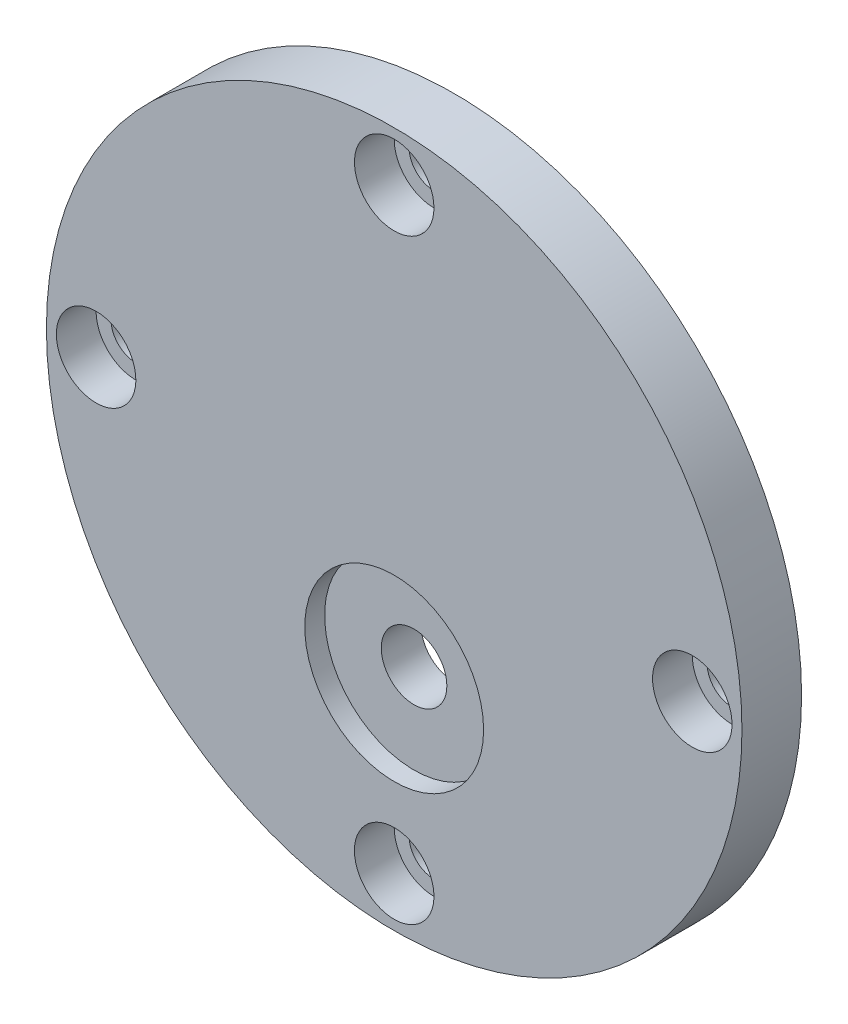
ISO-10303-21;
HEADER;
FILE_DESCRIPTION(('STEP AP214'),'2;1');
FILE_NAME('part.step','',(''),(''),'','','');
FILE_SCHEMA(('AUTOMOTIVE_DESIGN { 1 0 10303 214 1 1 1 1 }'));
ENDSEC;
DATA;
#1=APPLICATION_CONTEXT('core data for automotive mechanical design processes');
#2=APPLICATION_PROTOCOL_DEFINITION('international standard','automotive_design',2000,#1);
#3=PRODUCT_CONTEXT('',#1,'mechanical');
#4=PRODUCT('Part','Part','',(#3));
#5=PRODUCT_RELATED_PRODUCT_CATEGORY('part','',(#4));
#6=PRODUCT_DEFINITION_FORMATION('','',#4);
#7=PRODUCT_DEFINITION_CONTEXT('part definition',#1,'design');
#8=PRODUCT_DEFINITION('design','',#6,#7);
#9=PRODUCT_DEFINITION_SHAPE('','',#8);
#10=(LENGTH_UNIT() NAMED_UNIT(*) SI_UNIT(.MILLI.,.METRE.));
#11=(NAMED_UNIT(*) PLANE_ANGLE_UNIT() SI_UNIT($,.RADIAN.));
#12=(NAMED_UNIT(*) SI_UNIT($,.STERADIAN.) SOLID_ANGLE_UNIT());
#13=UNCERTAINTY_MEASURE_WITH_UNIT(LENGTH_MEASURE(1.E-05),#10,'distance_accuracy_value','');
#14=(GEOMETRIC_REPRESENTATION_CONTEXT(3) GLOBAL_UNCERTAINTY_ASSIGNED_CONTEXT((#13)) GLOBAL_UNIT_ASSIGNED_CONTEXT((#10,
#11,#12)) REPRESENTATION_CONTEXT('',''));
#15=CARTESIAN_POINT('',(0.,0.,0.));
#16=DIRECTION('',(0.,0.,1.));
#17=DIRECTION('',(1.,0.,0.));
#18=AXIS2_PLACEMENT_3D('',#15,#16,#17);
#19=CARTESIAN_POINT('',(0.,0.,6.));
#20=DIRECTION('',(0.,0.,-1.));
#21=DIRECTION('',(-1.,0.,0.));
#22=AXIS2_PLACEMENT_3D('',#19,#20,#21);
#23=CYLINDRICAL_SURFACE('',#22,35.);
#24=CARTESIAN_POINT('',(0.,0.,6.));
#25=DIRECTION('',(0.,0.,1.));
#26=DIRECTION('',(1.,0.,0.));
#27=AXIS2_PLACEMENT_3D('',#24,#25,#26);
#28=CIRCLE('',#27,35.);
#29=CARTESIAN_POINT('',(35.,0.,6.));
#30=VERTEX_POINT('',#29);
#31=EDGE_CURVE('E10',#30,#30,#28,.T.);
#32=ORIENTED_EDGE('',*,*,#31,.F.);
#33=EDGE_LOOP('',(#32));
#34=FACE_BOUND('',#33,.T.);
#35=CARTESIAN_POINT('',(0.,0.,0.));
#36=DIRECTION('',(0.,0.,1.));
#37=DIRECTION('',(1.,0.,0.));
#38=AXIS2_PLACEMENT_3D('',#35,#36,#37);
#39=CIRCLE('',#38,35.);
#40=CARTESIAN_POINT('',(35.,0.,0.));
#41=VERTEX_POINT('',#40);
#42=EDGE_CURVE('E33',#41,#41,#39,.T.);
#43=ORIENTED_EDGE('',*,*,#42,.T.);
#44=EDGE_LOOP('',(#43));
#45=FACE_BOUND('',#44,.T.);
#46=ADVANCED_FACE('F27',(#34,#45),#23,.T.);
#47=CARTESIAN_POINT('',(0.,0.,6.));
#48=DIRECTION('',(0.,0.,1.));
#49=DIRECTION('',(1.,0.,0.));
#50=AXIS2_PLACEMENT_3D('',#47,#48,#49);
#51=PLANE('',#50);
#52=CARTESIAN_POINT('',(0.,-13.,6.));
#53=DIRECTION('',(0.,0.,1.));
#54=DIRECTION('',(1.,0.,0.));
#55=AXIS2_PLACEMENT_3D('',#52,#53,#54);
#56=CIRCLE('',#55,9.);
#57=CARTESIAN_POINT('',(9.,-13.,6.));
#58=VERTEX_POINT('',#57);
#59=EDGE_CURVE('E91',#58,#58,#56,.T.);
#60=ORIENTED_EDGE('',*,*,#59,.F.);
#61=EDGE_LOOP('',(#60));
#62=FACE_BOUND('',#61,.T.);
#63=CARTESIAN_POINT('',(-30.,3.14233502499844E-13,6.));
#64=DIRECTION('',(0.,0.,1.));
#65=DIRECTION('',(0.,1.,0.));
#66=AXIS2_PLACEMENT_3D('',#63,#64,#65);
#67=CIRCLE('',#66,4.);
#68=CARTESIAN_POINT('',(-30.,4.00000000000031,6.));
#69=VERTEX_POINT('',#68);
#70=EDGE_CURVE('E67',#69,#69,#67,.T.);
#71=ORIENTED_EDGE('',*,*,#70,.F.);
#72=EDGE_LOOP('',(#71));
#73=FACE_BOUND('',#72,.T.);
#74=CARTESIAN_POINT('',(-2.09489001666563E-13,-30.,6.));
#75=DIRECTION('',(0.,0.,1.));
#76=DIRECTION('',(-1.,0.,0.));
#77=AXIS2_PLACEMENT_3D('',#74,#75,#76);
#78=CIRCLE('',#77,4.);
#79=CARTESIAN_POINT('',(-4.00000000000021,-30.,6.));
#80=VERTEX_POINT('',#79);
#81=EDGE_CURVE('E61',#80,#80,#78,.T.);
#82=ORIENTED_EDGE('',*,*,#81,.F.);
#83=EDGE_LOOP('',(#82));
#84=FACE_BOUND('',#83,.T.);
#85=CARTESIAN_POINT('',(30.,-1.04744500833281E-13,6.));
#86=DIRECTION('',(0.,0.,1.));
#87=DIRECTION('',(0.,-1.,0.));
#88=AXIS2_PLACEMENT_3D('',#85,#86,#87);
#89=CIRCLE('',#88,4.);
#90=CARTESIAN_POINT('',(30.,-4.0000000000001,6.));
#91=VERTEX_POINT('',#90);
#92=EDGE_CURVE('E55',#91,#91,#89,.T.);
#93=ORIENTED_EDGE('',*,*,#92,.F.);
#94=EDGE_LOOP('',(#93));
#95=FACE_BOUND('',#94,.T.);
#96=CARTESIAN_POINT('',(0.,30.,6.));
#97=DIRECTION('',(0.,0.,1.));
#98=DIRECTION('',(1.,0.,0.));
#99=AXIS2_PLACEMENT_3D('',#96,#97,#98);
#100=CIRCLE('',#99,4.);
#101=CARTESIAN_POINT('',(4.,30.,6.));
#102=VERTEX_POINT('',#101);
#103=EDGE_CURVE('E41',#102,#102,#100,.T.);
#104=ORIENTED_EDGE('',*,*,#103,.F.);
#105=EDGE_LOOP('',(#104));
#106=FACE_BOUND('',#105,.T.);
#107=ORIENTED_EDGE('',*,*,#31,.T.);
#108=EDGE_LOOP('',(#107));
#109=FACE_BOUND('',#108,.T.);
#110=ADVANCED_FACE('F116',(#62,#73,#84,#95,#106,#109),#51,.T.);
#111=CARTESIAN_POINT('',(0.,0.,0.));
#112=DIRECTION('',(0.,0.,1.));
#113=DIRECTION('',(1.,0.,0.));
#114=AXIS2_PLACEMENT_3D('',#111,#112,#113);
#115=PLANE('',#114);
#116=CARTESIAN_POINT('',(0.,-13.,0.));
#117=DIRECTION('',(0.,0.,1.));
#118=DIRECTION('',(1.,0.,0.));
#119=AXIS2_PLACEMENT_3D('',#116,#117,#118);
#120=CIRCLE('',#119,3.3);
#121=CARTESIAN_POINT('',(3.3,-13.,0.));
#122=VERTEX_POINT('',#121);
#123=EDGE_CURVE('E94',#122,#122,#120,.T.);
#124=ORIENTED_EDGE('',*,*,#123,.T.);
#125=EDGE_LOOP('',(#124));
#126=FACE_BOUND('',#125,.T.);
#127=CARTESIAN_POINT('',(-30.,3.14233502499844E-13,0.));
#128=DIRECTION('',(0.,0.,1.));
#129=DIRECTION('',(0.,1.,0.));
#130=AXIS2_PLACEMENT_3D('',#127,#128,#129);
#131=CIRCLE('',#130,2.5);
#132=CARTESIAN_POINT('',(-30.,2.50000000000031,0.));
#133=VERTEX_POINT('',#132);
#134=EDGE_CURVE('E82',#133,#133,#131,.T.);
#135=ORIENTED_EDGE('',*,*,#134,.T.);
#136=EDGE_LOOP('',(#135));
#137=FACE_BOUND('',#136,.T.);
#138=CARTESIAN_POINT('',(-2.09489001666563E-13,-30.,0.));
#139=DIRECTION('',(0.,0.,1.));
#140=DIRECTION('',(-1.,0.,0.));
#141=AXIS2_PLACEMENT_3D('',#138,#139,#140);
#142=CIRCLE('',#141,2.5);
#143=CARTESIAN_POINT('',(-2.50000000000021,-30.,0.));
#144=VERTEX_POINT('',#143);
#145=EDGE_CURVE('E76',#144,#144,#142,.T.);
#146=ORIENTED_EDGE('',*,*,#145,.T.);
#147=EDGE_LOOP('',(#146));
#148=FACE_BOUND('',#147,.T.);
#149=CARTESIAN_POINT('',(30.,-1.04744500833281E-13,0.));
#150=DIRECTION('',(0.,0.,1.));
#151=DIRECTION('',(0.,-1.,0.));
#152=AXIS2_PLACEMENT_3D('',#149,#150,#151);
#153=CIRCLE('',#152,2.5);
#154=CARTESIAN_POINT('',(30.,-2.5000000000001,0.));
#155=VERTEX_POINT('',#154);
#156=EDGE_CURVE('E70',#155,#155,#153,.T.);
#157=ORIENTED_EDGE('',*,*,#156,.T.);
#158=EDGE_LOOP('',(#157));
#159=FACE_BOUND('',#158,.T.);
#160=CARTESIAN_POINT('',(0.,30.,0.));
#161=DIRECTION('',(0.,0.,1.));
#162=DIRECTION('',(1.,0.,0.));
#163=AXIS2_PLACEMENT_3D('',#160,#161,#162);
#164=CIRCLE('',#163,2.5);
#165=CARTESIAN_POINT('',(2.5,30.,0.));
#166=VERTEX_POINT('',#165);
#167=EDGE_CURVE('E46',#166,#166,#164,.T.);
#168=ORIENTED_EDGE('',*,*,#167,.T.);
#169=EDGE_LOOP('',(#168));
#170=FACE_BOUND('',#169,.T.);
#171=ORIENTED_EDGE('',*,*,#42,.F.);
#172=EDGE_LOOP('',(#171));
#173=FACE_BOUND('',#172,.T.);
#174=ADVANCED_FACE('F119',(#126,#137,#148,#159,#170,#173),#115,.F.);
#175=CARTESIAN_POINT('',(0.,30.,2.));
#176=DIRECTION('',(0.,0.,1.));
#177=DIRECTION('',(1.,0.,0.));
#178=AXIS2_PLACEMENT_3D('',#175,#176,#177);
#179=CYLINDRICAL_SURFACE('',#178,4.);
#180=CARTESIAN_POINT('',(0.,30.,2.));
#181=DIRECTION('',(0.,0.,1.));
#182=DIRECTION('',(1.,0.,0.));
#183=AXIS2_PLACEMENT_3D('',#180,#181,#182);
#184=CIRCLE('',#183,4.);
#185=CARTESIAN_POINT('',(4.,30.,2.));
#186=VERTEX_POINT('',#185);
#187=EDGE_CURVE('E37',#186,#186,#184,.T.);
#188=ORIENTED_EDGE('',*,*,#187,.F.);
#189=EDGE_LOOP('',(#188));
#190=FACE_BOUND('',#189,.T.);
#191=ORIENTED_EDGE('',*,*,#103,.T.);
#192=EDGE_LOOP('',(#191));
#193=FACE_BOUND('',#192,.T.);
#194=ADVANCED_FACE('F128',(#190,#193),#179,.F.);
#195=CARTESIAN_POINT('',(0.,30.,2.));
#196=DIRECTION('',(0.,0.,1.));
#197=DIRECTION('',(1.,0.,0.));
#198=AXIS2_PLACEMENT_3D('',#195,#196,#197);
#199=PLANE('',#198);
#200=CARTESIAN_POINT('',(0.,30.,2.));
#201=DIRECTION('',(0.,0.,1.));
#202=DIRECTION('',(1.,0.,0.));
#203=AXIS2_PLACEMENT_3D('',#200,#201,#202);
#204=CIRCLE('',#203,2.5);
#205=CARTESIAN_POINT('',(2.5,30.,2.));
#206=VERTEX_POINT('',#205);
#207=EDGE_CURVE('E49',#206,#206,#204,.T.);
#208=ORIENTED_EDGE('',*,*,#207,.F.);
#209=EDGE_LOOP('',(#208));
#210=FACE_BOUND('',#209,.T.);
#211=ORIENTED_EDGE('',*,*,#187,.T.);
#212=EDGE_LOOP('',(#211));
#213=FACE_BOUND('',#212,.T.);
#214=ADVANCED_FACE('F130',(#210,#213),#199,.T.);
#215=CARTESIAN_POINT('',(0.,30.,0.));
#216=DIRECTION('',(0.,0.,1.));
#217=DIRECTION('',(1.,0.,0.));
#218=AXIS2_PLACEMENT_3D('',#215,#216,#217);
#219=CYLINDRICAL_SURFACE('',#218,2.5);
#220=ORIENTED_EDGE('',*,*,#167,.F.);
#221=EDGE_LOOP('',(#220));
#222=FACE_BOUND('',#221,.T.);
#223=ORIENTED_EDGE('',*,*,#207,.T.);
#224=EDGE_LOOP('',(#223));
#225=FACE_BOUND('',#224,.T.);
#226=ADVANCED_FACE('F137',(#222,#225),#219,.F.);
#227=CARTESIAN_POINT('',(30.,-1.04744500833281E-13,2.));
#228=DIRECTION('',(0.,0.,1.));
#229=DIRECTION('',(1.,0.,0.));
#230=AXIS2_PLACEMENT_3D('',#227,#228,#229);
#231=CYLINDRICAL_SURFACE('',#230,4.);
#232=CARTESIAN_POINT('',(30.,-1.04744500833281E-13,2.));
#233=DIRECTION('',(0.,0.,1.));
#234=DIRECTION('',(0.,-1.,0.));
#235=AXIS2_PLACEMENT_3D('',#232,#233,#234);
#236=CIRCLE('',#235,4.);
#237=CARTESIAN_POINT('',(30.,-4.0000000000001,2.));
#238=VERTEX_POINT('',#237);
#239=EDGE_CURVE('E52',#238,#238,#236,.T.);
#240=ORIENTED_EDGE('',*,*,#239,.F.);
#241=EDGE_LOOP('',(#240));
#242=FACE_BOUND('',#241,.T.);
#243=ORIENTED_EDGE('',*,*,#92,.T.);
#244=EDGE_LOOP('',(#243));
#245=FACE_BOUND('',#244,.T.);
#246=ADVANCED_FACE('F211',(#242,#245),#231,.F.);
#247=CARTESIAN_POINT('',(30.,-1.04744500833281E-13,2.));
#248=DIRECTION('',(0.,0.,1.));
#249=DIRECTION('',(0.,-1.,0.));
#250=AXIS2_PLACEMENT_3D('',#247,#248,#249);
#251=PLANE('',#250);
#252=CARTESIAN_POINT('',(30.,-1.04744500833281E-13,2.));
#253=DIRECTION('',(0.,0.,1.));
#254=DIRECTION('',(0.,-1.,0.));
#255=AXIS2_PLACEMENT_3D('',#252,#253,#254);
#256=CIRCLE('',#255,2.5);
#257=CARTESIAN_POINT('',(30.,-2.5000000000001,2.));
#258=VERTEX_POINT('',#257);
#259=EDGE_CURVE('E73',#258,#258,#256,.T.);
#260=ORIENTED_EDGE('',*,*,#259,.F.);
#261=EDGE_LOOP('',(#260));
#262=FACE_BOUND('',#261,.T.);
#263=ORIENTED_EDGE('',*,*,#239,.T.);
#264=EDGE_LOOP('',(#263));
#265=FACE_BOUND('',#264,.T.);
#266=ADVANCED_FACE('F207',(#262,#265),#251,.T.);
#267=CARTESIAN_POINT('',(-2.09489001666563E-13,-30.,2.));
#268=DIRECTION('',(0.,0.,1.));
#269=DIRECTION('',(1.,0.,0.));
#270=AXIS2_PLACEMENT_3D('',#267,#268,#269);
#271=CYLINDRICAL_SURFACE('',#270,4.);
#272=CARTESIAN_POINT('',(-2.09489001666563E-13,-30.,2.));
#273=DIRECTION('',(0.,0.,1.));
#274=DIRECTION('',(-1.,0.,0.));
#275=AXIS2_PLACEMENT_3D('',#272,#273,#274);
#276=CIRCLE('',#275,4.);
#277=CARTESIAN_POINT('',(-4.00000000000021,-30.,2.));
#278=VERTEX_POINT('',#277);
#279=EDGE_CURVE('E58',#278,#278,#276,.T.);
#280=ORIENTED_EDGE('',*,*,#279,.F.);
#281=EDGE_LOOP('',(#280));
#282=FACE_BOUND('',#281,.T.);
#283=ORIENTED_EDGE('',*,*,#81,.T.);
#284=EDGE_LOOP('',(#283));
#285=FACE_BOUND('',#284,.T.);
#286=ADVANCED_FACE('F203',(#282,#285),#271,.F.);
#287=CARTESIAN_POINT('',(-2.09489001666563E-13,-30.,2.));
#288=DIRECTION('',(0.,0.,1.));
#289=DIRECTION('',(-1.,0.,0.));
#290=AXIS2_PLACEMENT_3D('',#287,#288,#289);
#291=PLANE('',#290);
#292=CARTESIAN_POINT('',(-2.09489001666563E-13,-30.,2.));
#293=DIRECTION('',(0.,0.,1.));
#294=DIRECTION('',(-1.,0.,0.));
#295=AXIS2_PLACEMENT_3D('',#292,#293,#294);
#296=CIRCLE('',#295,2.5);
#297=CARTESIAN_POINT('',(-2.50000000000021,-30.,2.));
#298=VERTEX_POINT('',#297);
#299=EDGE_CURVE('E79',#298,#298,#296,.T.);
#300=ORIENTED_EDGE('',*,*,#299,.F.);
#301=EDGE_LOOP('',(#300));
#302=FACE_BOUND('',#301,.T.);
#303=ORIENTED_EDGE('',*,*,#279,.T.);
#304=EDGE_LOOP('',(#303));
#305=FACE_BOUND('',#304,.T.);
#306=ADVANCED_FACE('F199',(#302,#305),#291,.T.);
#307=CARTESIAN_POINT('',(-30.,3.14233502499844E-13,2.));
#308=DIRECTION('',(0.,0.,1.));
#309=DIRECTION('',(1.,0.,0.));
#310=AXIS2_PLACEMENT_3D('',#307,#308,#309);
#311=CYLINDRICAL_SURFACE('',#310,4.);
#312=CARTESIAN_POINT('',(-30.,3.14233502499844E-13,2.));
#313=DIRECTION('',(0.,0.,1.));
#314=DIRECTION('',(0.,1.,0.));
#315=AXIS2_PLACEMENT_3D('',#312,#313,#314);
#316=CIRCLE('',#315,4.);
#317=CARTESIAN_POINT('',(-30.,4.00000000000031,2.));
#318=VERTEX_POINT('',#317);
#319=EDGE_CURVE('E64',#318,#318,#316,.T.);
#320=ORIENTED_EDGE('',*,*,#319,.F.);
#321=EDGE_LOOP('',(#320));
#322=FACE_BOUND('',#321,.T.);
#323=ORIENTED_EDGE('',*,*,#70,.T.);
#324=EDGE_LOOP('',(#323));
#325=FACE_BOUND('',#324,.T.);
#326=ADVANCED_FACE('F195',(#322,#325),#311,.F.);
#327=CARTESIAN_POINT('',(-30.,3.14233502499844E-13,2.));
#328=DIRECTION('',(0.,0.,1.));
#329=DIRECTION('',(0.,1.,0.));
#330=AXIS2_PLACEMENT_3D('',#327,#328,#329);
#331=PLANE('',#330);
#332=CARTESIAN_POINT('',(-30.,3.14233502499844E-13,2.));
#333=DIRECTION('',(0.,0.,1.));
#334=DIRECTION('',(0.,1.,0.));
#335=AXIS2_PLACEMENT_3D('',#332,#333,#334);
#336=CIRCLE('',#335,2.5);
#337=CARTESIAN_POINT('',(-30.,2.50000000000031,2.));
#338=VERTEX_POINT('',#337);
#339=EDGE_CURVE('E85',#338,#338,#336,.T.);
#340=ORIENTED_EDGE('',*,*,#339,.F.);
#341=EDGE_LOOP('',(#340));
#342=FACE_BOUND('',#341,.T.);
#343=ORIENTED_EDGE('',*,*,#319,.T.);
#344=EDGE_LOOP('',(#343));
#345=FACE_BOUND('',#344,.T.);
#346=ADVANCED_FACE('F191',(#342,#345),#331,.T.);
#347=CARTESIAN_POINT('',(30.,-1.04744500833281E-13,0.));
#348=DIRECTION('',(0.,0.,1.));
#349=DIRECTION('',(1.,0.,0.));
#350=AXIS2_PLACEMENT_3D('',#347,#348,#349);
#351=CYLINDRICAL_SURFACE('',#350,2.5);
#352=ORIENTED_EDGE('',*,*,#156,.F.);
#353=EDGE_LOOP('',(#352));
#354=FACE_BOUND('',#353,.T.);
#355=ORIENTED_EDGE('',*,*,#259,.T.);
#356=EDGE_LOOP('',(#355));
#357=FACE_BOUND('',#356,.T.);
#358=ADVANCED_FACE('F187',(#354,#357),#351,.F.);
#359=CARTESIAN_POINT('',(-2.09489001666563E-13,-30.,0.));
#360=DIRECTION('',(0.,0.,1.));
#361=DIRECTION('',(1.,0.,0.));
#362=AXIS2_PLACEMENT_3D('',#359,#360,#361);
#363=CYLINDRICAL_SURFACE('',#362,2.5);
#364=ORIENTED_EDGE('',*,*,#145,.F.);
#365=EDGE_LOOP('',(#364));
#366=FACE_BOUND('',#365,.T.);
#367=ORIENTED_EDGE('',*,*,#299,.T.);
#368=EDGE_LOOP('',(#367));
#369=FACE_BOUND('',#368,.T.);
#370=ADVANCED_FACE('F183',(#366,#369),#363,.F.);
#371=CARTESIAN_POINT('',(-30.,3.14233502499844E-13,0.));
#372=DIRECTION('',(0.,0.,1.));
#373=DIRECTION('',(1.,0.,0.));
#374=AXIS2_PLACEMENT_3D('',#371,#372,#373);
#375=CYLINDRICAL_SURFACE('',#374,2.5);
#376=ORIENTED_EDGE('',*,*,#134,.F.);
#377=EDGE_LOOP('',(#376));
#378=FACE_BOUND('',#377,.T.);
#379=ORIENTED_EDGE('',*,*,#339,.T.);
#380=EDGE_LOOP('',(#379));
#381=FACE_BOUND('',#380,.T.);
#382=ADVANCED_FACE('F112',(#378,#381),#375,.F.);
#383=CARTESIAN_POINT('',(0.,-13.,4.));
#384=DIRECTION('',(0.,0.,1.));
#385=DIRECTION('',(1.,0.,0.));
#386=AXIS2_PLACEMENT_3D('',#383,#384,#385);
#387=CYLINDRICAL_SURFACE('',#386,9.);
#388=CARTESIAN_POINT('',(0.,-13.,4.));
#389=DIRECTION('',(0.,0.,1.));
#390=DIRECTION('',(1.,0.,0.));
#391=AXIS2_PLACEMENT_3D('',#388,#389,#390);
#392=CIRCLE('',#391,9.);
#393=CARTESIAN_POINT('',(9.,-13.,4.));
#394=VERTEX_POINT('',#393);
#395=EDGE_CURVE('E88',#394,#394,#392,.T.);
#396=ORIENTED_EDGE('',*,*,#395,.F.);
#397=EDGE_LOOP('',(#396));
#398=FACE_BOUND('',#397,.T.);
#399=ORIENTED_EDGE('',*,*,#59,.T.);
#400=EDGE_LOOP('',(#399));
#401=FACE_BOUND('',#400,.T.);
#402=ADVANCED_FACE('F106',(#398,#401),#387,.F.);
#403=CARTESIAN_POINT('',(0.,-13.,4.));
#404=DIRECTION('',(0.,0.,1.));
#405=DIRECTION('',(1.,0.,0.));
#406=AXIS2_PLACEMENT_3D('',#403,#404,#405);
#407=PLANE('',#406);
#408=CARTESIAN_POINT('',(0.,-13.,4.));
#409=DIRECTION('',(0.,0.,1.));
#410=DIRECTION('',(1.,0.,0.));
#411=AXIS2_PLACEMENT_3D('',#408,#409,#410);
#412=CIRCLE('',#411,3.29999999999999);
#413=CARTESIAN_POINT('',(3.29999999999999,-13.,4.));
#414=VERTEX_POINT('',#413);
#415=EDGE_CURVE('E97',#414,#414,#412,.T.);
#416=ORIENTED_EDGE('',*,*,#415,.F.);
#417=EDGE_LOOP('',(#416));
#418=FACE_BOUND('',#417,.T.);
#419=ORIENTED_EDGE('',*,*,#395,.T.);
#420=EDGE_LOOP('',(#419));
#421=FACE_BOUND('',#420,.T.);
#422=ADVANCED_FACE('F103',(#418,#421),#407,.T.);
#423=CARTESIAN_POINT('',(0.,-13.,4.));
#424=DIRECTION('',(0.,0.,1.));
#425=DIRECTION('',(1.,0.,0.));
#426=AXIS2_PLACEMENT_3D('',#423,#424,#425);
#427=CYLINDRICAL_SURFACE('',#426,3.29999999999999);
#428=ORIENTED_EDGE('',*,*,#123,.F.);
#429=EDGE_LOOP('',(#428));
#430=FACE_BOUND('',#429,.T.);
#431=ORIENTED_EDGE('',*,*,#415,.T.);
#432=EDGE_LOOP('',(#431));
#433=FACE_BOUND('',#432,.T.);
#434=ADVANCED_FACE('F101',(#430,#433),#427,.F.);
#435=CLOSED_SHELL('',(#46,#110,#174,#194,#214,#226,#246,#266,#286,#306,#326,#346,#358,#370,#382,
#402,#422,#434));
#436=MANIFOLD_SOLID_BREP('B2',#435);
#437=ADVANCED_BREP_SHAPE_REPRESENTATION('',(#18,#436),#14);
#438=SHAPE_DEFINITION_REPRESENTATION(#9,#437);
ENDSEC;
END-ISO-10303-21;
